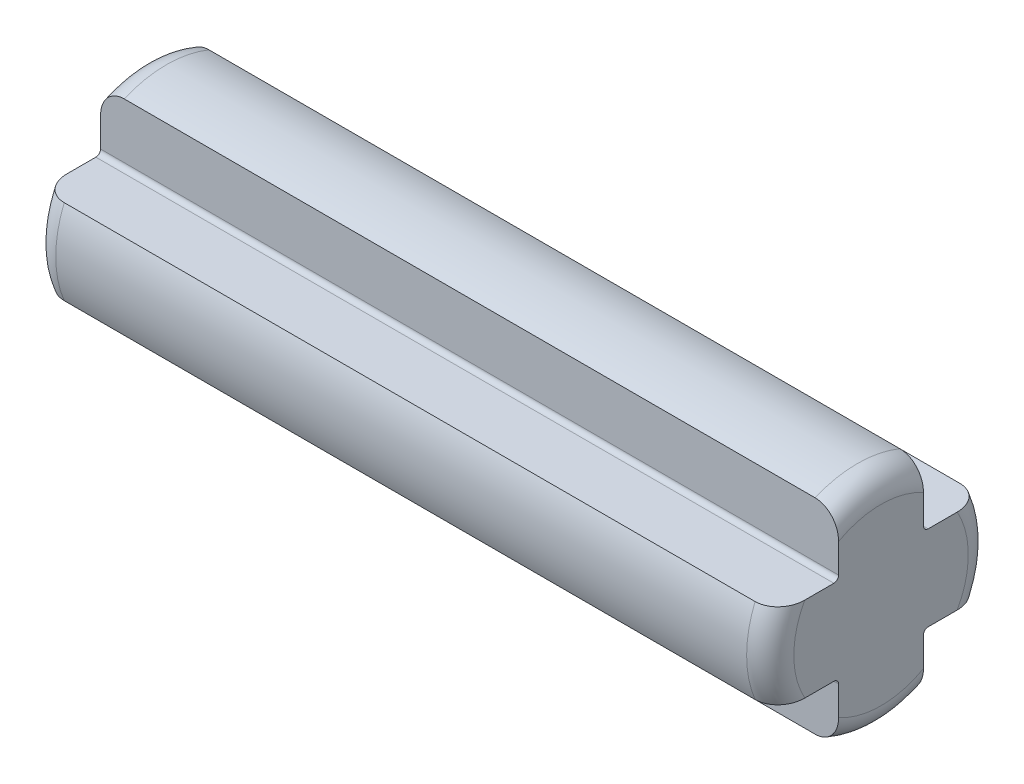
from build123d import *

# Parameters (mm, degrees)
EXTRUIR1_DEPTH = 7.825
REDONDEO1_R    = 0.5


with BuildPart() as part:
    # Croquis1 → Extruir1 (new, symmetric)
    with BuildSketch(Plane(origin=(0, 0, 0), x_dir=(0, 0, -1), z_dir=(1, 0, 0))):
        with BuildLine():
            Line((-0.9, 2.170829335), (-0.9, 1))
            ThreePointArc((-0.9, 1), (-0.929289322, 0.929289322), (-1, 0.9))
            Line((-1, 0.9), (-2.170829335, 0.9))
            ThreePointArc((-2.170829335, 0.9), (-2.35, 0), (-2.170829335, -0.9))
            Line((-2.170829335, -0.9), (-1, -0.9))
            ThreePointArc((-1, -0.9), (-0.929289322, -0.929289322), (-0.9, -1))
            Line((-0.9, -1), (-0.9, -2.170829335))
            ThreePointArc((-0.9, -2.170829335), (0, -2.35), (0.9, -2.170829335))
            Line((0.9, -2.170829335), (0.9, -1))
            ThreePointArc((0.9, -1), (0.929289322, -0.929289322), (1, -0.9))
            Line((1, -0.9), (2.170829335, -0.9))
            ThreePointArc((2.170829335, -0.9), (2.35, 0), (2.170829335, 0.9))
            Line((2.170829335, 0.9), (1, 0.9))
            ThreePointArc((1, 0.9), (0.929289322, 0.929289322), (0.9, 1))
            Line((0.9, 1), (0.9, 2.170829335))
            ThreePointArc((0.9, 2.170829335), (0, 2.35), (-0.9, 2.170829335))
        make_face()
    extrude(amount=EXTRUIR1_DEPTH, both=True)

    # Redondeo1
    redondeo1_edges = [part.edges().sort_by_distance(p)[0] for p in [
        (-7.825, 2.35, 0),
        (7.825, -2.35, 0),
        (-7.825, 0, -2.35),
        (-7.825, -2.35, 0),
        (-7.825, 0, 2.35),
        (7.825, 0, -2.35),
        (7.825, 0, 2.35),
        (7.825, 2.35, 0),
    ]]
    fillet(redondeo1_edges, radius=REDONDEO1_R)


solid = part.part
